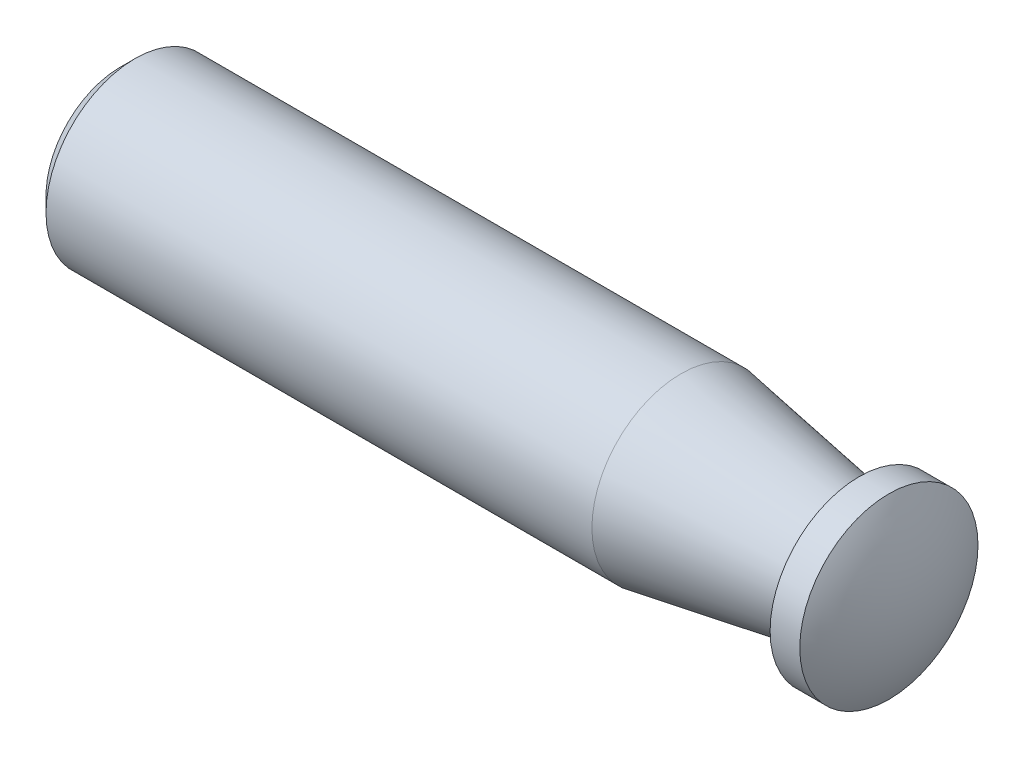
from build123d import *

# Parameters (mm, degrees)
CHANFREIN1_SIZE = 0.5


with BuildPart() as part:
    # Esquisse1 → Base-R_volution (revolve)
    with BuildSketch(Plane.XY, mode=Mode.PRIVATE) as base_r_volution_sk:
        with BuildLine():
            Line((0, 0), (0, 3))
            Line((0, 3), (18.88, 3))
            Line((18.88, 3), (24.88, 2))
            Line((24.88, 2), (24.88, 3))
            Line((24.88, 3), (25.88, 3))
            ThreePointArc((25.88, 3), (26.499375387, 1.556476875), (26.710951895, 0))
            Line((26.710951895, 0), (0, 0))
        make_face()
    revolve(base_r_volution_sk.sketch.rotate(Axis((-25.074358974, 0, 0), (1, 0, 0)), 90), axis=Axis((-25.074358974, 0, 0), (1, 0, 0)))

    # Chanfrein1
    chanfrein1_edges = [part.edges().sort_by_distance(p)[0] for p in [
        (0, 0, -3),
    ]]
    chamfer(chanfrein1_edges, length=CHANFREIN1_SIZE)


solid = part.part
